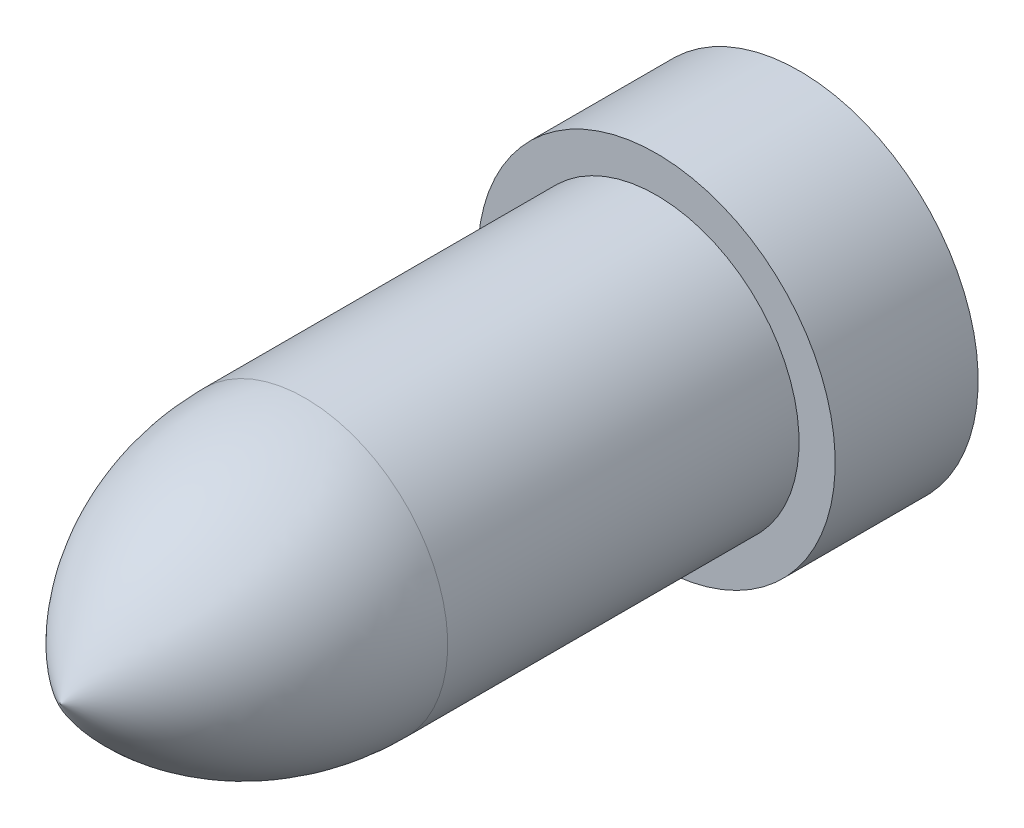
ISO-10303-21;
HEADER;
FILE_DESCRIPTION(('STEP AP214'),'2;1');
FILE_NAME('part.step','',(''),(''),'','','');
FILE_SCHEMA(('AUTOMOTIVE_DESIGN { 1 0 10303 214 1 1 1 1 }'));
ENDSEC;
DATA;
#1=APPLICATION_CONTEXT('core data for automotive mechanical design processes');
#2=APPLICATION_PROTOCOL_DEFINITION('international standard','automotive_design',2000,#1);
#3=PRODUCT_CONTEXT('',#1,'mechanical');
#4=PRODUCT('Part','Part','',(#3));
#5=PRODUCT_RELATED_PRODUCT_CATEGORY('part','',(#4));
#6=PRODUCT_DEFINITION_FORMATION('','',#4);
#7=PRODUCT_DEFINITION_CONTEXT('part definition',#1,'design');
#8=PRODUCT_DEFINITION('design','',#6,#7);
#9=PRODUCT_DEFINITION_SHAPE('','',#8);
#10=(LENGTH_UNIT() NAMED_UNIT(*) SI_UNIT(.MILLI.,.METRE.));
#11=(NAMED_UNIT(*) PLANE_ANGLE_UNIT() SI_UNIT($,.RADIAN.));
#12=(NAMED_UNIT(*) SI_UNIT($,.STERADIAN.) SOLID_ANGLE_UNIT());
#13=UNCERTAINTY_MEASURE_WITH_UNIT(LENGTH_MEASURE(1.E-05),#10,'distance_accuracy_value','');
#14=(GEOMETRIC_REPRESENTATION_CONTEXT(3) GLOBAL_UNCERTAINTY_ASSIGNED_CONTEXT((#13)) GLOBAL_UNIT_ASSIGNED_CONTEXT((#10,
#11,#12)) REPRESENTATION_CONTEXT('',''));
#15=CARTESIAN_POINT('',(0.,0.,0.));
#16=DIRECTION('',(0.,0.,1.));
#17=DIRECTION('',(1.,0.,0.));
#18=AXIS2_PLACEMENT_3D('',#15,#16,#17);
#19=CARTESIAN_POINT('',(0.,0.,-4.77519999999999));
#20=DIRECTION('',(0.,0.,1.));
#21=DIRECTION('',(1.00000000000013,0.,0.));
#22=AXIS2_PLACEMENT_3D('',#19,#20,#21);
#23=PLANE('',#22);
#24=CARTESIAN_POINT('',(0.,0.,-4.77519999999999));
#25=DIRECTION('',(0.,0.,-1.));
#26=DIRECTION('',(-1.00000000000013,0.,0.));
#27=AXIS2_PLACEMENT_3D('',#24,#25,#26);
#28=CIRCLE('',#27,5.96900000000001);
#29=CARTESIAN_POINT('',(-5.96900000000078,0.,-4.77519999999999));
#30=VERTEX_POINT('',#29);
#31=EDGE_CURVE('E78',#30,#30,#28,.T.);
#32=ORIENTED_EDGE('',*,*,#31,.T.);
#33=EDGE_LOOP('',(#32));
#34=FACE_BOUND('',#33,.T.);
#35=ADVANCED_FACE('F43',(#34),#23,.F.);
#36=CARTESIAN_POINT('',(4.6355000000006,0.,11.7348));
#37=DIRECTION('',(0.,-1.00000000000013,0.));
#38=DIRECTION('',(-1.00000000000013,0.,0.));
#39=AXIS2_PLACEMENT_3D('',#36,#37,#38);
#40=CIRCLE('',#39,9.398);
#41=TRIMMED_CURVE('',#40,(PARAMETER_VALUE(-1.05498216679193)),
(PARAMETER_VALUE(1.05498216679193)),.T.,.PARAMETER.);
#42=CARTESIAN_POINT('',(0.,0.,11.7348));
#43=DIRECTION('',(0.,0.,-1.));
#44=AXIS1_PLACEMENT('',#42,#43);
#45=SURFACE_OF_REVOLUTION('',#41,#44);
#46=CARTESIAN_POINT('',(0.,0.,11.7348));
#47=DIRECTION('',(0.,0.,-1.));
#48=DIRECTION('',(-1.00000000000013,0.,0.));
#49=AXIS2_PLACEMENT_3D('',#46,#47,#48);
#50=CIRCLE('',#49,4.7625);
#51=CARTESIAN_POINT('',(-4.76250000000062,0.,11.7348));
#52=VERTEX_POINT('',#51);
#53=EDGE_CURVE('E11',#52,#52,#50,.T.);
#54=ORIENTED_EDGE('',*,*,#53,.F.);
#55=EDGE_LOOP('',(#54));
#56=FACE_BOUND('',#55,.T.);
#57=CARTESIAN_POINT('',(0.,0.,19.9100396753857));
#58=VERTEX_POINT('',#57);
#59=VERTEX_LOOP('',#58);
#60=FACE_BOUND('',#59,.T.);
#61=ADVANCED_FACE('F53',(#56,#60),#45,.T.);
#62=CARTESIAN_POINT('',(0.,0.,-41.5372037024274));
#63=DIRECTION('',(0.,0.,-1.));
#64=DIRECTION('',(-1.00000000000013,0.,0.));
#65=AXIS2_PLACEMENT_3D('',#62,#63,#64);
#66=CYLINDRICAL_SURFACE('',#65,4.7625);
#67=CARTESIAN_POINT('',(0.,0.,0.));
#68=DIRECTION('',(0.,0.,-1.));
#69=DIRECTION('',(-1.00000000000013,0.,0.));
#70=AXIS2_PLACEMENT_3D('',#67,#68,#69);
#71=CIRCLE('',#70,4.7625);
#72=CARTESIAN_POINT('',(-4.76250000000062,0.,0.));
#73=VERTEX_POINT('',#72);
#74=EDGE_CURVE('E50',#73,#73,#71,.T.);
#75=ORIENTED_EDGE('',*,*,#74,.F.);
#76=EDGE_LOOP('',(#75));
#77=FACE_BOUND('',#76,.T.);
#78=ORIENTED_EDGE('',*,*,#53,.T.);
#79=EDGE_LOOP('',(#78));
#80=FACE_BOUND('',#79,.T.);
#81=ADVANCED_FACE('F55',(#77,#80),#66,.T.);
#82=CARTESIAN_POINT('',(-4.76249999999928,2.72004641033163E-12,-1.90819582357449E-13));
#83=DIRECTION('',(0.,0.,-1.));
#84=DIRECTION('',(-1.00000000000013,0.,0.));
#85=AXIS2_PLACEMENT_3D('',#82,#83,#84);
#86=PLANE('',#85);
#87=CARTESIAN_POINT('',(0.,0.,0.));
#88=DIRECTION('',(0.,0.,-1.));
#89=DIRECTION('',(-1.00000000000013,0.,0.));
#90=AXIS2_PLACEMENT_3D('',#87,#88,#89);
#91=CIRCLE('',#90,5.969);
#92=CARTESIAN_POINT('',(-5.96900000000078,0.,0.));
#93=VERTEX_POINT('',#92);
#94=EDGE_CURVE('E81',#93,#93,#91,.T.);
#95=ORIENTED_EDGE('',*,*,#94,.F.);
#96=EDGE_LOOP('',(#95));
#97=FACE_BOUND('',#96,.T.);
#98=ORIENTED_EDGE('',*,*,#74,.T.);
#99=EDGE_LOOP('',(#98));
#100=FACE_BOUND('',#99,.T.);
#101=ADVANCED_FACE('F61',(#97,#100),#86,.F.);
#102=CARTESIAN_POINT('',(0.,0.,-41.5372037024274));
#103=DIRECTION('',(0.,0.,-1.));
#104=DIRECTION('',(-1.00000000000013,0.,0.));
#105=AXIS2_PLACEMENT_3D('',#102,#103,#104);
#106=CYLINDRICAL_SURFACE('',#105,5.96900000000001);
#107=ORIENTED_EDGE('',*,*,#31,.F.);
#108=EDGE_LOOP('',(#107));
#109=FACE_BOUND('',#108,.T.);
#110=ORIENTED_EDGE('',*,*,#94,.T.);
#111=EDGE_LOOP('',(#110));
#112=FACE_BOUND('',#111,.T.);
#113=ADVANCED_FACE('F69',(#109,#112),#106,.T.);
#114=CLOSED_SHELL('',(#35,#61,#81,#101,#113));
#115=MANIFOLD_SOLID_BREP('B2',#114);
#116=ADVANCED_BREP_SHAPE_REPRESENTATION('',(#18,#115),#14);
#117=SHAPE_DEFINITION_REPRESENTATION(#9,#116);
ENDSEC;
END-ISO-10303-21;
